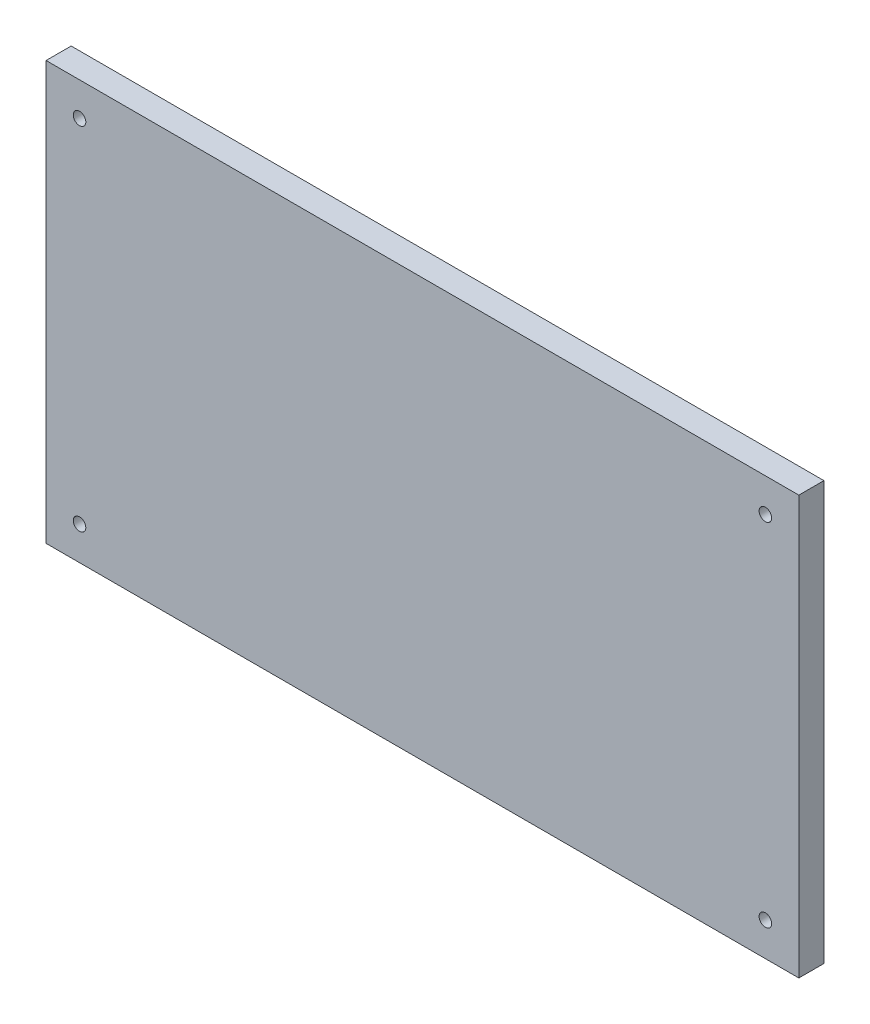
ISO-10303-21;
HEADER;
FILE_DESCRIPTION(('STEP AP214'),'2;1');
FILE_NAME('part.step','',(''),(''),'','','');
FILE_SCHEMA(('AUTOMOTIVE_DESIGN { 1 0 10303 214 1 1 1 1 }'));
ENDSEC;
DATA;
#1=APPLICATION_CONTEXT('core data for automotive mechanical design processes');
#2=APPLICATION_PROTOCOL_DEFINITION('international standard','automotive_design',2000,#1);
#3=PRODUCT_CONTEXT('',#1,'mechanical');
#4=PRODUCT('Part','Part','',(#3));
#5=PRODUCT_RELATED_PRODUCT_CATEGORY('part','',(#4));
#6=PRODUCT_DEFINITION_FORMATION('','',#4);
#7=PRODUCT_DEFINITION_CONTEXT('part definition',#1,'design');
#8=PRODUCT_DEFINITION('design','',#6,#7);
#9=PRODUCT_DEFINITION_SHAPE('','',#8);
#10=(LENGTH_UNIT() NAMED_UNIT(*) SI_UNIT(.MILLI.,.METRE.));
#11=(NAMED_UNIT(*) PLANE_ANGLE_UNIT() SI_UNIT($,.RADIAN.));
#12=(NAMED_UNIT(*) SI_UNIT($,.STERADIAN.) SOLID_ANGLE_UNIT());
#13=UNCERTAINTY_MEASURE_WITH_UNIT(LENGTH_MEASURE(1.E-05),#10,'distance_accuracy_value','');
#14=(GEOMETRIC_REPRESENTATION_CONTEXT(3) GLOBAL_UNCERTAINTY_ASSIGNED_CONTEXT((#13)) GLOBAL_UNIT_ASSIGNED_CONTEXT((#10,
#11,#12)) REPRESENTATION_CONTEXT('',''));
#15=CARTESIAN_POINT('',(0.,0.,0.));
#16=DIRECTION('',(0.,0.,1.));
#17=DIRECTION('',(1.,0.,0.));
#18=AXIS2_PLACEMENT_3D('',#15,#16,#17);
#19=CARTESIAN_POINT('',(-270.432692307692,149.399038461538,15.));
#20=DIRECTION('',(1.,0.,0.));
#21=DIRECTION('',(0.,0.,-1.));
#22=AXIS2_PLACEMENT_3D('',#19,#20,#21);
#23=PLANE('',#22);
#24=DIRECTION('',(0.,-1.,0.));
#25=VECTOR('',#24,1.);
#26=CARTESIAN_POINT('',(-270.432692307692,149.399038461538,0.));
#27=LINE('',#26,#25);
#28=CARTESIAN_POINT('',(-270.432692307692,149.399038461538,0.));
#29=VERTEX_POINT('',#28);
#30=CARTESIAN_POINT('',(-270.432692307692,-100.600961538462,0.));
#31=VERTEX_POINT('',#30);
#32=EDGE_CURVE('E108',#29,#31,#27,.T.);
#33=ORIENTED_EDGE('',*,*,#32,.T.);
#34=DIRECTION('',(0.,0.,-1.));
#35=VECTOR('',#34,1.);
#36=CARTESIAN_POINT('',(-270.432692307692,-100.600961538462,15.));
#37=LINE('',#36,#35);
#38=CARTESIAN_POINT('',(-270.432692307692,-100.600961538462,15.));
#39=VERTEX_POINT('',#38);
#40=EDGE_CURVE('E11',#39,#31,#37,.T.);
#41=ORIENTED_EDGE('',*,*,#40,.F.);
#42=DIRECTION('',(0.,-1.,0.));
#43=VECTOR('',#42,1.);
#44=CARTESIAN_POINT('',(-270.432692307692,149.399038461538,15.));
#45=LINE('',#44,#43);
#46=CARTESIAN_POINT('',(-270.432692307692,149.399038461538,15.));
#47=VERTEX_POINT('',#46);
#48=EDGE_CURVE('E92',#47,#39,#45,.T.);
#49=ORIENTED_EDGE('',*,*,#48,.F.);
#50=DIRECTION('',(0.,0.,-1.));
#51=VECTOR('',#50,1.);
#52=CARTESIAN_POINT('',(-270.432692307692,149.399038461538,15.));
#53=LINE('',#52,#51);
#54=EDGE_CURVE('E104',#47,#29,#53,.T.);
#55=ORIENTED_EDGE('',*,*,#54,.T.);
#56=EDGE_LOOP('',(#33,#41,#49,#55));
#57=FACE_BOUND('',#56,.T.);
#58=ADVANCED_FACE('F40',(#57),#23,.F.);
#59=CARTESIAN_POINT('',(-270.432692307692,-100.600961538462,15.));
#60=DIRECTION('',(0.,1.,0.));
#61=DIRECTION('',(0.,0.,1.));
#62=AXIS2_PLACEMENT_3D('',#59,#60,#61);
#63=PLANE('',#62);
#64=DIRECTION('',(1.,0.,0.));
#65=VECTOR('',#64,1.);
#66=CARTESIAN_POINT('',(-270.432692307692,-100.600961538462,0.));
#67=LINE('',#66,#65);
#68=CARTESIAN_POINT('',(179.567307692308,-100.600961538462,0.));
#69=VERTEX_POINT('',#68);
#70=EDGE_CURVE('E97',#31,#69,#67,.T.);
#71=ORIENTED_EDGE('',*,*,#70,.T.);
#72=DIRECTION('',(0.,0.,-1.));
#73=VECTOR('',#72,1.);
#74=CARTESIAN_POINT('',(179.567307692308,-100.600961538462,15.));
#75=LINE('',#74,#73);
#76=CARTESIAN_POINT('',(179.567307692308,-100.600961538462,15.));
#77=VERTEX_POINT('',#76);
#78=EDGE_CURVE('E49',#77,#69,#75,.T.);
#79=ORIENTED_EDGE('',*,*,#78,.F.);
#80=DIRECTION('',(1.,0.,0.));
#81=VECTOR('',#80,1.);
#82=CARTESIAN_POINT('',(-270.432692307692,-100.600961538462,15.));
#83=LINE('',#82,#81);
#84=EDGE_CURVE('E87',#39,#77,#83,.T.);
#85=ORIENTED_EDGE('',*,*,#84,.F.);
#86=ORIENTED_EDGE('',*,*,#40,.T.);
#87=EDGE_LOOP('',(#71,#79,#85,#86));
#88=FACE_BOUND('',#87,.T.);
#89=ADVANCED_FACE('F96',(#88),#63,.F.);
#90=CARTESIAN_POINT('',(179.567307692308,149.399038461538,15.));
#91=DIRECTION('',(-1.,0.,0.));
#92=DIRECTION('',(0.,0.,1.));
#93=AXIS2_PLACEMENT_3D('',#90,#91,#92);
#94=PLANE('',#93);
#95=DIRECTION('',(0.,1.,0.));
#96=VECTOR('',#95,1.);
#97=CARTESIAN_POINT('',(179.567307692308,149.399038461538,0.));
#98=LINE('',#97,#96);
#99=CARTESIAN_POINT('',(179.567307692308,149.399038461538,0.));
#100=VERTEX_POINT('',#99);
#101=EDGE_CURVE('E74',#69,#100,#98,.T.);
#102=ORIENTED_EDGE('',*,*,#101,.T.);
#103=DIRECTION('',(0.,0.,-1.));
#104=VECTOR('',#103,1.);
#105=CARTESIAN_POINT('',(179.567307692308,149.399038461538,15.));
#106=LINE('',#105,#104);
#107=CARTESIAN_POINT('',(179.567307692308,149.399038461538,15.));
#108=VERTEX_POINT('',#107);
#109=EDGE_CURVE('E99',#108,#100,#106,.T.);
#110=ORIENTED_EDGE('',*,*,#109,.F.);
#111=DIRECTION('',(0.,1.,0.));
#112=VECTOR('',#111,1.);
#113=CARTESIAN_POINT('',(179.567307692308,149.399038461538,15.));
#114=LINE('',#113,#112);
#115=EDGE_CURVE('E90',#77,#108,#114,.T.);
#116=ORIENTED_EDGE('',*,*,#115,.F.);
#117=ORIENTED_EDGE('',*,*,#78,.T.);
#118=EDGE_LOOP('',(#102,#110,#116,#117));
#119=FACE_BOUND('',#118,.T.);
#120=ADVANCED_FACE('F100',(#119),#94,.F.);
#121=CARTESIAN_POINT('',(-270.432692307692,149.399038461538,15.));
#122=DIRECTION('',(0.,-1.,0.));
#123=DIRECTION('',(0.,0.,-1.));
#124=AXIS2_PLACEMENT_3D('',#121,#122,#123);
#125=PLANE('',#124);
#126=DIRECTION('',(-1.,0.,0.));
#127=VECTOR('',#126,1.);
#128=CARTESIAN_POINT('',(-270.432692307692,149.399038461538,0.));
#129=LINE('',#128,#127);
#130=EDGE_CURVE('E80',#100,#29,#129,.T.);
#131=ORIENTED_EDGE('',*,*,#130,.T.);
#132=ORIENTED_EDGE('',*,*,#54,.F.);
#133=DIRECTION('',(-1.,0.,0.));
#134=VECTOR('',#133,1.);
#135=CARTESIAN_POINT('',(-270.432692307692,149.399038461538,15.));
#136=LINE('',#135,#134);
#137=EDGE_CURVE('E57',#108,#47,#136,.T.);
#138=ORIENTED_EDGE('',*,*,#137,.F.);
#139=ORIENTED_EDGE('',*,*,#109,.T.);
#140=EDGE_LOOP('',(#131,#132,#138,#139));
#141=FACE_BOUND('',#140,.T.);
#142=ADVANCED_FACE('F122',(#141),#125,.F.);
#143=CARTESIAN_POINT('',(0.,0.,15.));
#144=DIRECTION('',(0.,0.,1.));
#145=DIRECTION('',(1.,0.,0.));
#146=AXIS2_PLACEMENT_3D('',#143,#144,#145);
#147=PLANE('',#146);
#148=CARTESIAN_POINT('',(-250.432692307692,129.399038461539,15.));
#149=DIRECTION('',(0.,0.,1.));
#150=DIRECTION('',(1.,0.,0.));
#151=AXIS2_PLACEMENT_3D('',#148,#149,#150);
#152=CIRCLE('',#151,3.75000000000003);
#153=CARTESIAN_POINT('',(-246.682692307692,129.399038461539,15.));
#154=VERTEX_POINT('',#153);
#155=EDGE_CURVE('E112',#154,#154,#152,.F.);
#156=ORIENTED_EDGE('',*,*,#155,.T.);
#157=EDGE_LOOP('',(#156));
#158=FACE_BOUND('',#157,.T.);
#159=CARTESIAN_POINT('',(-250.432692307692,-80.6009615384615,15.));
#160=DIRECTION('',(0.,0.,1.));
#161=DIRECTION('',(1.,0.,0.));
#162=AXIS2_PLACEMENT_3D('',#159,#160,#161);
#163=CIRCLE('',#162,3.75000000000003);
#164=CARTESIAN_POINT('',(-246.682692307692,-80.6009615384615,15.));
#165=VERTEX_POINT('',#164);
#166=EDGE_CURVE('E132',#165,#165,#163,.F.);
#167=ORIENTED_EDGE('',*,*,#166,.T.);
#168=EDGE_LOOP('',(#167));
#169=FACE_BOUND('',#168,.T.);
#170=CARTESIAN_POINT('',(159.567307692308,-80.6009615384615,15.));
#171=DIRECTION('',(0.,0.,1.));
#172=DIRECTION('',(1.,0.,0.));
#173=AXIS2_PLACEMENT_3D('',#170,#171,#172);
#174=CIRCLE('',#173,3.75000000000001);
#175=CARTESIAN_POINT('',(163.317307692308,-80.6009615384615,15.));
#176=VERTEX_POINT('',#175);
#177=EDGE_CURVE('E136',#176,#176,#174,.F.);
#178=ORIENTED_EDGE('',*,*,#177,.T.);
#179=EDGE_LOOP('',(#178));
#180=FACE_BOUND('',#179,.T.);
#181=CARTESIAN_POINT('',(159.567307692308,129.399038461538,15.));
#182=DIRECTION('',(0.,0.,1.));
#183=DIRECTION('',(1.,0.,0.));
#184=AXIS2_PLACEMENT_3D('',#181,#182,#183);
#185=CIRCLE('',#184,3.75000000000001);
#186=CARTESIAN_POINT('',(163.317307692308,129.399038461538,15.));
#187=VERTEX_POINT('',#186);
#188=EDGE_CURVE('E140',#187,#187,#185,.F.);
#189=ORIENTED_EDGE('',*,*,#188,.T.);
#190=EDGE_LOOP('',(#189));
#191=FACE_BOUND('',#190,.T.);
#192=ORIENTED_EDGE('',*,*,#48,.T.);
#193=ORIENTED_EDGE('',*,*,#84,.T.);
#194=ORIENTED_EDGE('',*,*,#115,.T.);
#195=ORIENTED_EDGE('',*,*,#137,.T.);
#196=EDGE_LOOP('',(#192,#193,#194,#195));
#197=FACE_BOUND('',#196,.T.);
#198=ADVANCED_FACE('F88',(#158,#169,#180,#191,#197),#147,.T.);
#199=CARTESIAN_POINT('',(0.,0.,0.));
#200=DIRECTION('',(0.,0.,1.));
#201=DIRECTION('',(1.,0.,0.));
#202=AXIS2_PLACEMENT_3D('',#199,#200,#201);
#203=PLANE('',#202);
#204=CARTESIAN_POINT('',(-250.432692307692,129.399038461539,0.));
#205=DIRECTION('',(0.,0.,1.));
#206=DIRECTION('',(-1.,0.,0.));
#207=AXIS2_PLACEMENT_3D('',#204,#205,#206);
#208=CIRCLE('',#207,3.75000000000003);
#209=CARTESIAN_POINT('',(-254.182692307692,129.399038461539,0.));
#210=VERTEX_POINT('',#209);
#211=EDGE_CURVE('E149',#210,#210,#208,.T.);
#212=ORIENTED_EDGE('',*,*,#211,.T.);
#213=EDGE_LOOP('',(#212));
#214=FACE_BOUND('',#213,.T.);
#215=CARTESIAN_POINT('',(-250.432692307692,-80.6009615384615,0.));
#216=DIRECTION('',(0.,0.,1.));
#217=DIRECTION('',(1.,0.,0.));
#218=AXIS2_PLACEMENT_3D('',#215,#216,#217);
#219=CIRCLE('',#218,3.75000000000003);
#220=CARTESIAN_POINT('',(-246.682692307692,-80.6009615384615,0.));
#221=VERTEX_POINT('',#220);
#222=EDGE_CURVE('E153',#221,#221,#219,.T.);
#223=ORIENTED_EDGE('',*,*,#222,.T.);
#224=EDGE_LOOP('',(#223));
#225=FACE_BOUND('',#224,.T.);
#226=CARTESIAN_POINT('',(159.567307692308,-80.6009615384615,0.));
#227=DIRECTION('',(0.,0.,1.));
#228=DIRECTION('',(-1.,0.,0.));
#229=AXIS2_PLACEMENT_3D('',#226,#227,#228);
#230=CIRCLE('',#229,3.75000000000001);
#231=CARTESIAN_POINT('',(155.817307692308,-80.6009615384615,0.));
#232=VERTEX_POINT('',#231);
#233=EDGE_CURVE('E148',#232,#232,#230,.T.);
#234=ORIENTED_EDGE('',*,*,#233,.T.);
#235=EDGE_LOOP('',(#234));
#236=FACE_BOUND('',#235,.T.);
#237=CARTESIAN_POINT('',(159.567307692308,129.399038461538,0.));
#238=DIRECTION('',(0.,0.,1.));
#239=DIRECTION('',(1.,0.,0.));
#240=AXIS2_PLACEMENT_3D('',#237,#238,#239);
#241=CIRCLE('',#240,3.75000000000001);
#242=CARTESIAN_POINT('',(163.317307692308,129.399038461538,0.));
#243=VERTEX_POINT('',#242);
#244=EDGE_CURVE('E144',#243,#243,#241,.T.);
#245=ORIENTED_EDGE('',*,*,#244,.T.);
#246=EDGE_LOOP('',(#245));
#247=FACE_BOUND('',#246,.T.);
#248=ORIENTED_EDGE('',*,*,#32,.F.);
#249=ORIENTED_EDGE('',*,*,#130,.F.);
#250=ORIENTED_EDGE('',*,*,#101,.F.);
#251=ORIENTED_EDGE('',*,*,#70,.F.);
#252=EDGE_LOOP('',(#248,#249,#250,#251));
#253=FACE_BOUND('',#252,.T.);
#254=ADVANCED_FACE('F125',(#214,#225,#236,#247,#253),#203,.F.);
#255=CARTESIAN_POINT('',(159.567307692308,129.399038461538,65.));
#256=DIRECTION('',(0.,0.,-1.));
#257=DIRECTION('',(-1.,0.,0.));
#258=AXIS2_PLACEMENT_3D('',#255,#256,#257);
#259=CYLINDRICAL_SURFACE('',#258,3.75000000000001);
#260=ORIENTED_EDGE('',*,*,#188,.F.);
#261=EDGE_LOOP('',(#260));
#262=FACE_BOUND('',#261,.T.);
#263=ORIENTED_EDGE('',*,*,#244,.F.);
#264=EDGE_LOOP('',(#263));
#265=FACE_BOUND('',#264,.T.);
#266=ADVANCED_FACE('F166',(#262,#265),#259,.F.);
#267=CARTESIAN_POINT('',(159.567307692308,-80.6009615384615,65.));
#268=DIRECTION('',(0.,0.,-1.));
#269=DIRECTION('',(-1.,0.,0.));
#270=AXIS2_PLACEMENT_3D('',#267,#268,#269);
#271=CYLINDRICAL_SURFACE('',#270,3.75000000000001);
#272=ORIENTED_EDGE('',*,*,#177,.F.);
#273=EDGE_LOOP('',(#272));
#274=FACE_BOUND('',#273,.T.);
#275=ORIENTED_EDGE('',*,*,#233,.F.);
#276=EDGE_LOOP('',(#275));
#277=FACE_BOUND('',#276,.T.);
#278=ADVANCED_FACE('F163',(#274,#277),#271,.F.);
#279=CARTESIAN_POINT('',(-250.432692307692,-80.6009615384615,65.));
#280=DIRECTION('',(0.,0.,-1.));
#281=DIRECTION('',(-1.,0.,0.));
#282=AXIS2_PLACEMENT_3D('',#279,#280,#281);
#283=CYLINDRICAL_SURFACE('',#282,3.75000000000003);
#284=ORIENTED_EDGE('',*,*,#166,.F.);
#285=EDGE_LOOP('',(#284));
#286=FACE_BOUND('',#285,.T.);
#287=ORIENTED_EDGE('',*,*,#222,.F.);
#288=EDGE_LOOP('',(#287));
#289=FACE_BOUND('',#288,.T.);
#290=ADVANCED_FACE('F165',(#286,#289),#283,.F.);
#291=CARTESIAN_POINT('',(-250.432692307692,129.399038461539,65.));
#292=DIRECTION('',(0.,0.,-1.));
#293=DIRECTION('',(-1.,0.,0.));
#294=AXIS2_PLACEMENT_3D('',#291,#292,#293);
#295=CYLINDRICAL_SURFACE('',#294,3.75000000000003);
#296=ORIENTED_EDGE('',*,*,#155,.F.);
#297=EDGE_LOOP('',(#296));
#298=FACE_BOUND('',#297,.T.);
#299=ORIENTED_EDGE('',*,*,#211,.F.);
#300=EDGE_LOOP('',(#299));
#301=FACE_BOUND('',#300,.T.);
#302=ADVANCED_FACE('F173',(#298,#301),#295,.F.);
#303=CLOSED_SHELL('',(#58,#89,#120,#142,#198,#254,#266,#278,#290,#302));
#304=MANIFOLD_SOLID_BREP('B2',#303);
#305=ADVANCED_BREP_SHAPE_REPRESENTATION('',(#18,#304),#14);
#306=SHAPE_DEFINITION_REPRESENTATION(#9,#305);
ENDSEC;
END-ISO-10303-21;
